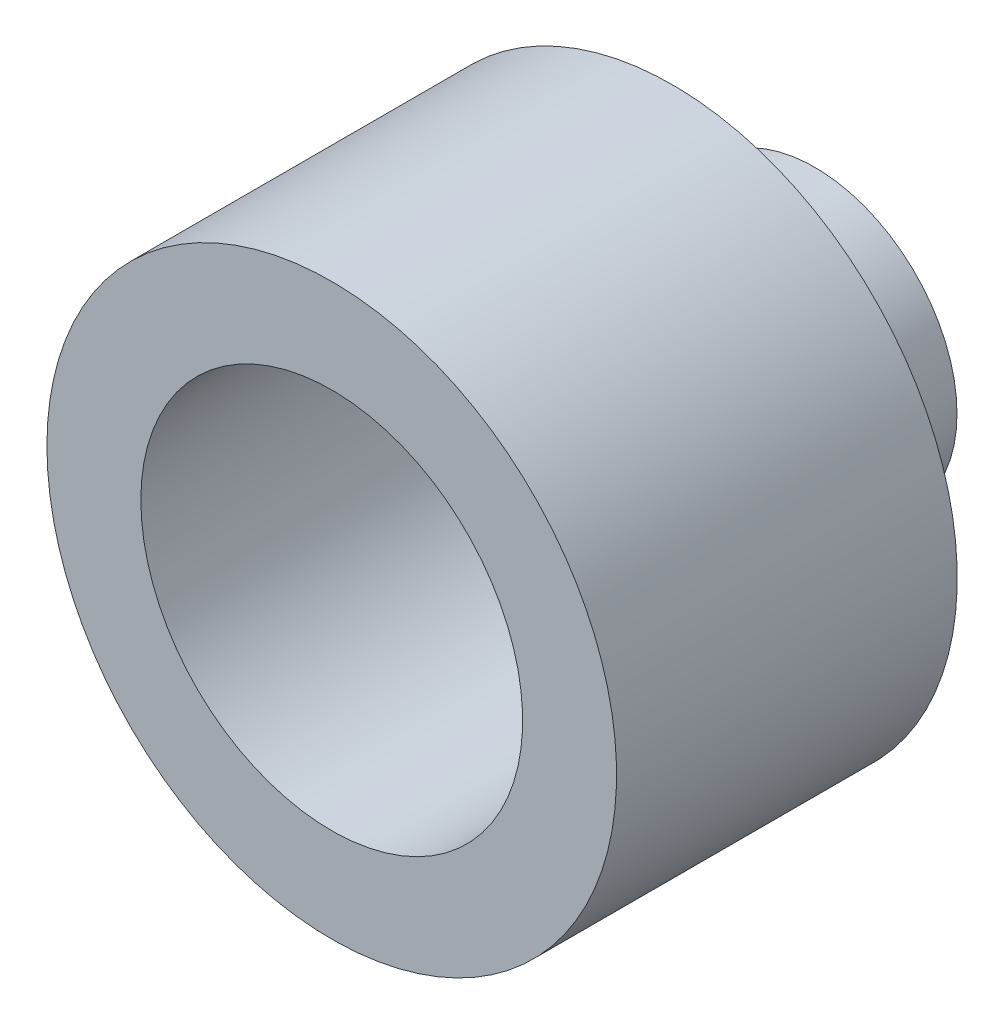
from build123d import *

# Parameters (mm, degrees)
SKETCH15_R                = 3.50012
F_7MM_DEPTH               = 58.48426857
FILLET1_R                 = 2
M5X0_8_TAPPED_HOLE1_D     = 4.2
M5X0_8_TAPPED_HOLE1_DEPTH = 13.208
M5X0_8_TAPPED_HOLE1_TIP   = 1.2618073
M5X0_8_TAPPED_HOLE2_D     = 4.2
M5X0_8_TAPPED_HOLE2_DEPTH = 13.208
M5X0_8_TAPPED_HOLE2_TIP   = 1.2618073


with BuildPart() as part:
    # Sketch1 → Revolve1 (revolve)
    with BuildSketch(Plane(origin=(0, 0, 0), x_dir=(0, 0, -1), z_dir=(1, 0, 0)), mode=Mode.PRIVATE) as revolve1_sk:
        Polygon((0, 26.035), (0, 17.4498), (28.194, 17.4498), (28.194, 0), (44.1452, 0), (44.1452, 13.0048), (31.1404, 13.0048), (31.1404, 26.035), align=None)
    revolve(revolve1_sk.sketch.rotate(Axis((0, 0, 0), (0, 0, 1)), 90), axis=Axis((0, 0, 0), (0, 0, 1)))

    # Sketch15 → 7mm (cut, through all)
    with BuildSketch(Plane(origin=(0, 0, -44.1452), x_dir=(-1, 0, 0), z_dir=(0, 0, -1))):
        Circle(SKETCH15_R)
    extrude(amount=-F_7MM_DEPTH, mode=Mode.SUBTRACT)

    # Fillet1
    fillet1_edges = [part.edges().sort_by_distance(p)[0] for p in [
        (13.0048, 0, -31.1404),
    ]]
    fillet(fillet1_edges, radius=FILLET1_R)

    # M5x0.8 Tapped Hole1
    with Locations(Plane(origin=(-13.0048, 0, -35.8648), x_dir=(0, 0, -1), z_dir=(-1, 0, 0))):
        with Locations((0, 0)):
            Hole(M5X0_8_TAPPED_HOLE1_D / 2, depth=M5X0_8_TAPPED_HOLE1_DEPTH)
            with Locations((0, 0, -(M5X0_8_TAPPED_HOLE1_DEPTH + M5X0_8_TAPPED_HOLE1_TIP / 2))):  # 118° drill point
                Cone(0, M5X0_8_TAPPED_HOLE1_D / 2, M5X0_8_TAPPED_HOLE1_TIP, mode=Mode.SUBTRACT)

    # M5x0.8 Tapped Hole2
    with Locations(Plane(origin=(0, 13.0048, -38.8648), x_dir=(1, 0, 0), z_dir=(0, 1, 0))):
        with Locations((0, 0)):
            Hole(M5X0_8_TAPPED_HOLE2_D / 2, depth=M5X0_8_TAPPED_HOLE2_DEPTH)
            with Locations((0, 0, -(M5X0_8_TAPPED_HOLE2_DEPTH + M5X0_8_TAPPED_HOLE2_TIP / 2))):  # 118° drill point
                Cone(0, M5X0_8_TAPPED_HOLE2_D / 2, M5X0_8_TAPPED_HOLE2_TIP, mode=Mode.SUBTRACT)


solid = part.part
